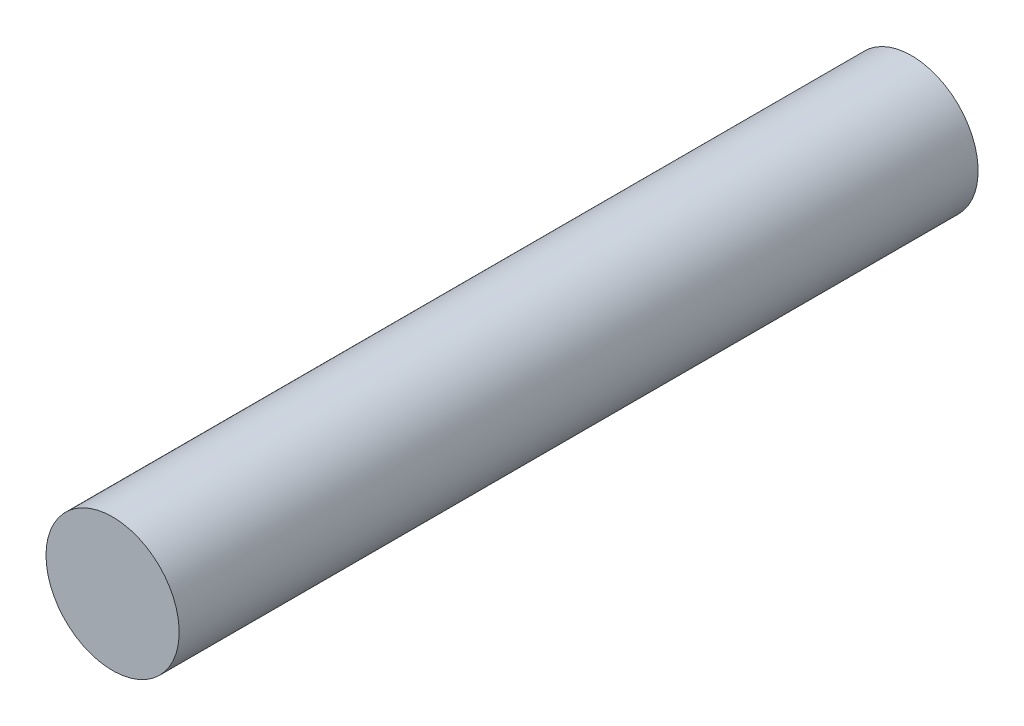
from build123d import *

# Parameters (mm, degrees)
SKETCH1_R          = 12.7
BASE_EXTRUDE_DEPTH = 152.4


with BuildPart() as part:
    # Sketch1 → Base-Extrude (new body)
    with BuildSketch(Plane.XY):
        with Locations(Location((0, 0, 0), (0, 0, 180))):
            Circle(SKETCH1_R)
    extrude(amount=BASE_EXTRUDE_DEPTH)


solid = part.part
